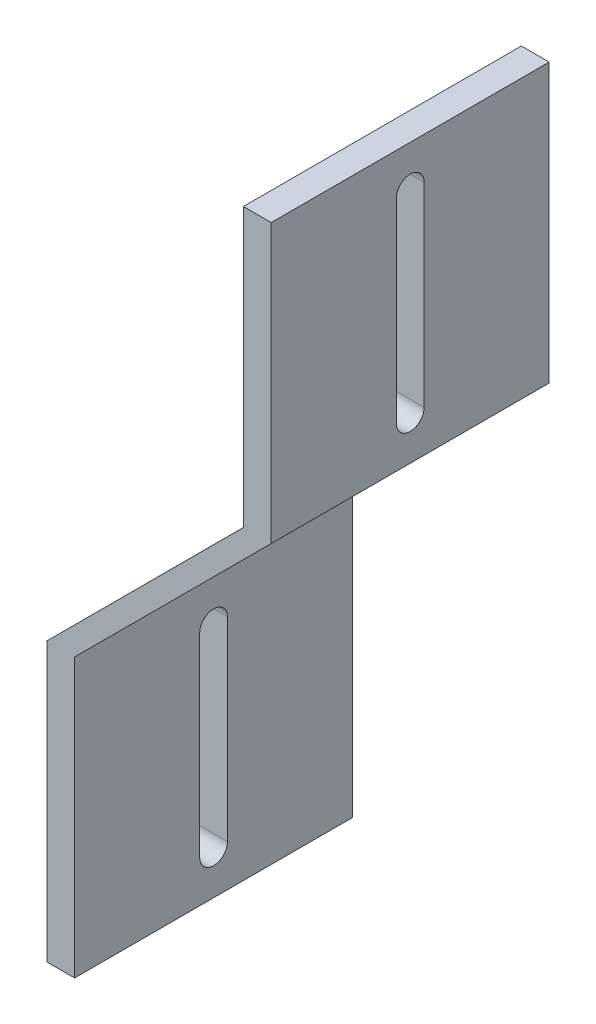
from build123d import *

# Parameters (mm, degrees)
BOSS_EXTRUDE1_DEPTH = 50.8
CUT_EXTRUDE1_DEPTH  = 5.08
CUT_EXTRUDE2_DEPTH  = 5.08


with BuildPart() as part:
    # Sketch1 → Boss-Extrude1 (new body)
    with BuildSketch(Plane.XY):
        Polygon((12.027005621, 39.62796424), (47.95345377, 75.54356424), (47.95345377, 126.34356424), (42.87345377, 126.34356424), (42.87345377, 75.54356424), (6.947005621, 39.62796424), (6.947005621, -11.17203576), (12.027005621, -11.17203576), align=None)
    extrude(amount=BOSS_EXTRUDE1_DEPTH)

    # Sketch2 → Cut-Extrude1 (cut)
    with BuildSketch(Plane.ZY.offset(-42.87345377)):
        with BuildLine():
            Line((22.86, 83.129337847), (22.86, 118.757790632))
            ThreePointArc((22.86, 118.757790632), (25.4, 121.297790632), (27.94, 118.757790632))
            Line((27.94, 118.757790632), (27.94, 83.129337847))
            ThreePointArc((27.94, 83.129337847), (25.4, 80.589337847), (22.86, 83.129337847))
        make_face()
    extrude(amount=-CUT_EXTRUDE1_DEPTH, mode=Mode.SUBTRACT)

    # Sketch3 → Cut-Extrude2 (cut)
    with BuildSketch(Plane.ZY.offset(-6.947005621)):
        with BuildLine():
            Line((22.86, -3.55203576), (22.86, 32.00796424))
            ThreePointArc((22.86, 32.00796424), (25.4, 34.54796424), (27.94, 32.00796424))
            Line((27.94, 32.00796424), (27.94, -3.55203576))
            ThreePointArc((27.94, -3.55203576), (25.4, -6.09203576), (22.86, -3.55203576))
        make_face()
    extrude(amount=-CUT_EXTRUDE2_DEPTH, mode=Mode.SUBTRACT)


solid = part.part
